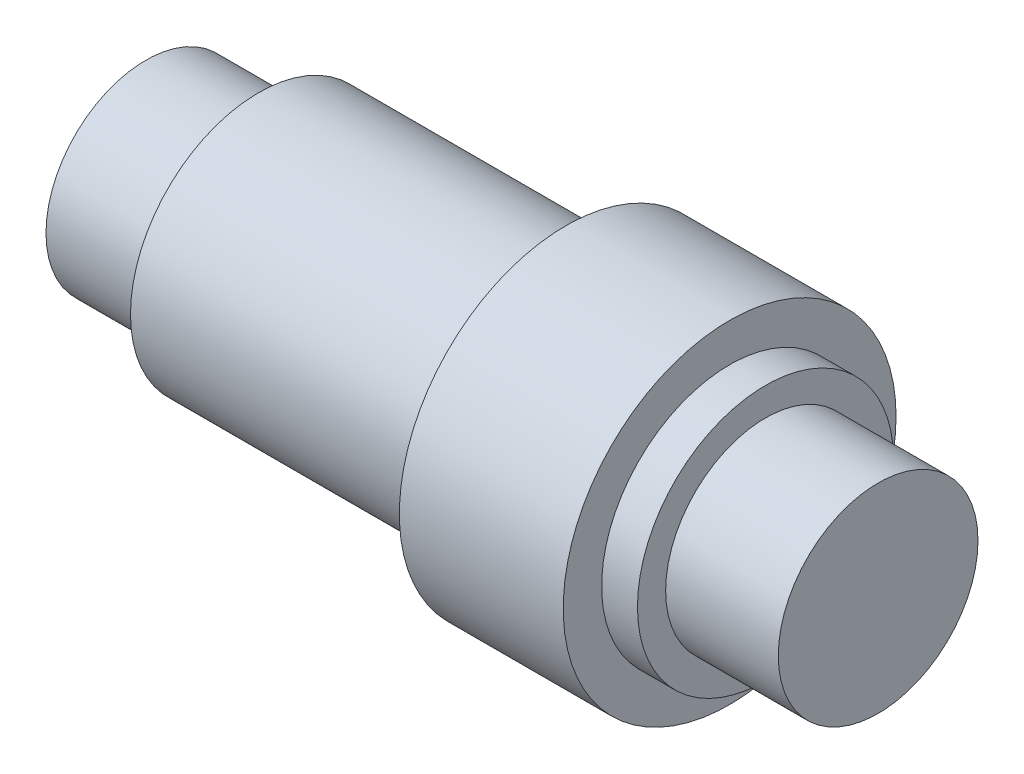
from build123d import *

# Parameters (mm, degrees)
ESBO_O1_R                = 1.95
RESSALTO_EXTRUS_O1_DEPTH = 7.15
ESBO_O3_R                = 3.25
RESSALTO_EXTRUS_O3_DEPTH = 1.6
RESSALTO_EXTRUS_O2_REACH = 14.944
ESBO_O2_R                = 2.5


with BuildPart() as part:
    # Esbo_o1 → Ressalto-extrus_o1 (new, symmetric)
    with BuildSketch(Plane(origin=(0, 0, 0), x_dir=(0, 0, -1), z_dir=(1, 0, 0))):
        Circle(ESBO_O1_R)
    extrude(amount=RESSALTO_EXTRUS_O1_DEPTH, both=True)

    # Esbo_o3 → Ressalto-extrus_o3 (add, symmetric)
    with BuildSketch(Plane(origin=(2.65, 0, 0), x_dir=(0, 0, -1), z_dir=(1, 0, 0))):
        Circle(ESBO_O3_R)
    extrude(amount=RESSALTO_EXTRUS_O3_DEPTH, both=True)

    # Esbo_o2 → Ressalto-extrus_o2 (add, up to next)
    with BuildSketch(Plane.ZY.offset(4.95), mode=Mode.PRIVATE) as ressalto_extrus_o2_sk1:
        Circle(ESBO_O2_R)
    ressalto_extrus_o2_tool1 = extrude(ressalto_extrus_o2_sk1.sketch, amount=-RESSALTO_EXTRUS_O2_REACH, mode=Mode.PRIVATE) - part.part
    ressalto_extrus_o2 = ressalto_extrus_o2_tool1.solids().sort_by_distance((-4.95, 0, 0))[0]
    add(ressalto_extrus_o2)

    # Espelhar1: Ressalto-extrus_o2 across plane
    add(ressalto_extrus_o2.mirror(Plane(origin=(0, 0, 0), x_dir=(0, 0, 1), z_dir=(1, 0, 0))))


solid = part.part
